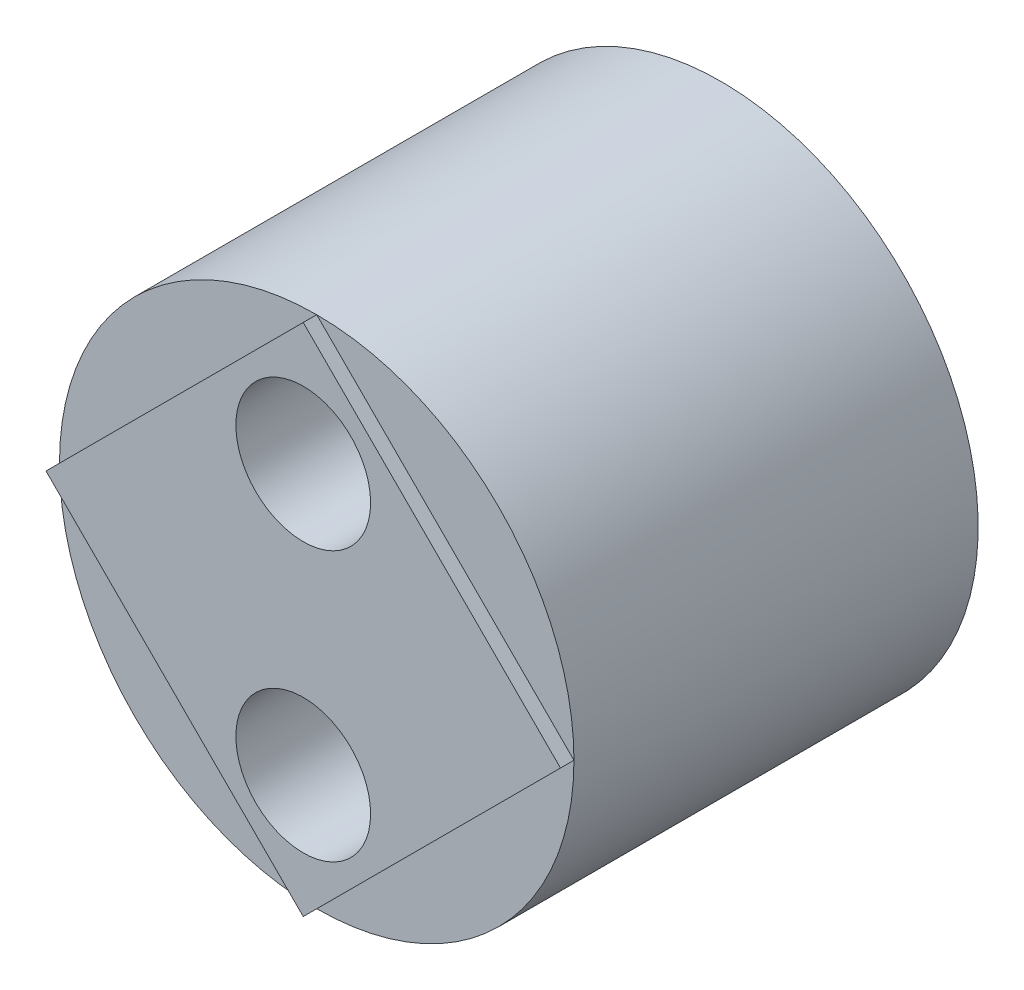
ISO-10303-21;
HEADER;
FILE_DESCRIPTION(('STEP AP214'),'2;1');
FILE_NAME('part.step','',(''),(''),'','','');
FILE_SCHEMA(('AUTOMOTIVE_DESIGN { 1 0 10303 214 1 1 1 1 }'));
ENDSEC;
DATA;
#1=APPLICATION_CONTEXT('core data for automotive mechanical design processes');
#2=APPLICATION_PROTOCOL_DEFINITION('international standard','automotive_design',2000,#1);
#3=PRODUCT_CONTEXT('',#1,'mechanical');
#4=PRODUCT('Part','Part','',(#3));
#5=PRODUCT_RELATED_PRODUCT_CATEGORY('part','',(#4));
#6=PRODUCT_DEFINITION_FORMATION('','',#4);
#7=PRODUCT_DEFINITION_CONTEXT('part definition',#1,'design');
#8=PRODUCT_DEFINITION('design','',#6,#7);
#9=PRODUCT_DEFINITION_SHAPE('','',#8);
#10=(LENGTH_UNIT() NAMED_UNIT(*) SI_UNIT(.MILLI.,.METRE.));
#11=(NAMED_UNIT(*) PLANE_ANGLE_UNIT() SI_UNIT($,.RADIAN.));
#12=(NAMED_UNIT(*) SI_UNIT($,.STERADIAN.) SOLID_ANGLE_UNIT());
#13=UNCERTAINTY_MEASURE_WITH_UNIT(LENGTH_MEASURE(1.E-05),#10,'distance_accuracy_value','');
#14=(GEOMETRIC_REPRESENTATION_CONTEXT(3) GLOBAL_UNCERTAINTY_ASSIGNED_CONTEXT((#13)) GLOBAL_UNIT_ASSIGNED_CONTEXT((#10,
#11,#12)) REPRESENTATION_CONTEXT('',''));
#15=CARTESIAN_POINT('',(0.,0.,0.));
#16=DIRECTION('',(0.,0.,1.));
#17=DIRECTION('',(1.,0.,0.));
#18=AXIS2_PLACEMENT_3D('',#15,#16,#17);
#19=CARTESIAN_POINT('',(0.,0.,-66.));
#20=DIRECTION('',(0.,0.,1.));
#21=DIRECTION('',(1.,0.,0.));
#22=AXIS2_PLACEMENT_3D('',#19,#20,#21);
#23=CYLINDRICAL_SURFACE('',#22,19.0918830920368);
#24=CARTESIAN_POINT('',(0.,0.,30.));
#25=DIRECTION('',(0.,0.,1.));
#26=DIRECTION('',(1.,0.,0.));
#27=AXIS2_PLACEMENT_3D('',#24,#25,#26);
#28=CIRCLE('',#27,19.0918830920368);
#29=CARTESIAN_POINT('',(0.,-19.0918830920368,30.));
#30=VERTEX_POINT('',#29);
#31=CARTESIAN_POINT('',(19.0918830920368,0.,30.));
#32=VERTEX_POINT('',#31);
#33=EDGE_CURVE('E67',#30,#32,#28,.T.);
#34=ORIENTED_EDGE('',*,*,#33,.F.);
#35=CARTESIAN_POINT('',(-19.0918830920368,0.,30.));
#36=VERTEX_POINT('',#35);
#37=EDGE_CURVE('E57',#36,#30,#28,.T.);
#38=ORIENTED_EDGE('',*,*,#37,.F.);
#39=CARTESIAN_POINT('',(0.,19.0918830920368,30.));
#40=VERTEX_POINT('',#39);
#41=EDGE_CURVE('E54',#40,#36,#28,.T.);
#42=ORIENTED_EDGE('',*,*,#41,.F.);
#43=EDGE_CURVE('E29',#32,#40,#28,.T.);
#44=ORIENTED_EDGE('',*,*,#43,.F.);
#45=EDGE_LOOP('',(#34,#38,#42,#44));
#46=FACE_BOUND('',#45,.T.);
#47=CARTESIAN_POINT('',(0.,0.,0.));
#48=DIRECTION('',(0.,0.,-1.));
#49=DIRECTION('',(-1.,0.,0.));
#50=AXIS2_PLACEMENT_3D('',#47,#48,#49);
#51=CIRCLE('',#50,19.0918830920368);
#52=CARTESIAN_POINT('',(-19.0918830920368,0.,0.));
#53=VERTEX_POINT('',#52);
#54=EDGE_CURVE('E60',#53,#53,#51,.T.);
#55=ORIENTED_EDGE('',*,*,#54,.F.);
#56=EDGE_LOOP('',(#55));
#57=FACE_BOUND('',#56,.T.);
#58=ADVANCED_FACE('F14',(#46,#57),#23,.T.);
#59=CARTESIAN_POINT('',(-25.,-25.,30.));
#60=DIRECTION('',(0.,0.,1.));
#61=DIRECTION('',(1.,0.,0.));
#62=AXIS2_PLACEMENT_3D('',#59,#60,#61);
#63=PLANE('',#62);
#64=DIRECTION('',(-0.707106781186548,0.707106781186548,0.));
#65=VECTOR('',#64,1.);
#66=CARTESIAN_POINT('',(0.,19.0918830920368,30.));
#67=LINE('',#66,#65);
#68=EDGE_CURVE('E65',#32,#40,#67,.T.);
#69=ORIENTED_EDGE('',*,*,#68,.F.);
#70=ORIENTED_EDGE('',*,*,#43,.T.);
#71=EDGE_LOOP('',(#69,#70));
#72=FACE_BOUND('',#71,.T.);
#73=ADVANCED_FACE('F16',(#72),#63,.T.);
#74=DIRECTION('',(-0.707106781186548,-0.707106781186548,0.));
#75=VECTOR('',#74,1.);
#76=CARTESIAN_POINT('',(-19.0918830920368,0.,30.));
#77=LINE('',#76,#75);
#78=EDGE_CURVE('E84',#40,#36,#77,.T.);
#79=ORIENTED_EDGE('',*,*,#78,.F.);
#80=ORIENTED_EDGE('',*,*,#41,.T.);
#81=EDGE_LOOP('',(#79,#80));
#82=FACE_BOUND('',#81,.T.);
#83=ADVANCED_FACE('F87',(#82),#63,.T.);
#84=DIRECTION('',(0.707106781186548,-0.707106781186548,0.));
#85=VECTOR('',#84,1.);
#86=CARTESIAN_POINT('',(-19.0918830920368,0.,30.));
#87=LINE('',#86,#85);
#88=EDGE_CURVE('E88',#36,#30,#87,.T.);
#89=ORIENTED_EDGE('',*,*,#88,.F.);
#90=ORIENTED_EDGE('',*,*,#37,.T.);
#91=EDGE_LOOP('',(#89,#90));
#92=FACE_BOUND('',#91,.T.);
#93=ADVANCED_FACE('F124',(#92),#63,.T.);
#94=DIRECTION('',(0.707106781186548,0.707106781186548,0.));
#95=VECTOR('',#94,1.);
#96=CARTESIAN_POINT('',(0.,-19.0918830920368,30.));
#97=LINE('',#96,#95);
#98=EDGE_CURVE('E78',#30,#32,#97,.T.);
#99=ORIENTED_EDGE('',*,*,#98,.F.);
#100=ORIENTED_EDGE('',*,*,#33,.T.);
#101=EDGE_LOOP('',(#99,#100));
#102=FACE_BOUND('',#101,.T.);
#103=ADVANCED_FACE('F109',(#102),#63,.T.);
#104=CARTESIAN_POINT('',(-19.0918830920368,0.,31.));
#105=DIRECTION('',(0.707106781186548,-0.707106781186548,0.));
#106=DIRECTION('',(0.707106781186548,0.707106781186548,0.));
#107=AXIS2_PLACEMENT_3D('',#104,#105,#106);
#108=PLANE('',#107);
#109=ORIENTED_EDGE('',*,*,#78,.T.);
#110=DIRECTION('',(0.,0.,-1.));
#111=VECTOR('',#110,1.);
#112=CARTESIAN_POINT('',(-19.0918830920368,0.,31.));
#113=LINE('',#112,#111);
#114=CARTESIAN_POINT('',(-19.0918830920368,0.,31.));
#115=VERTEX_POINT('',#114);
#116=EDGE_CURVE('E9',#115,#36,#113,.T.);
#117=ORIENTED_EDGE('',*,*,#116,.F.);
#118=DIRECTION('',(-0.707106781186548,-0.707106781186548,0.));
#119=VECTOR('',#118,1.);
#120=CARTESIAN_POINT('',(-19.0918830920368,0.,31.));
#121=LINE('',#120,#119);
#122=CARTESIAN_POINT('',(0.,19.0918830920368,31.));
#123=VERTEX_POINT('',#122);
#124=EDGE_CURVE('E77',#123,#115,#121,.T.);
#125=ORIENTED_EDGE('',*,*,#124,.F.);
#126=DIRECTION('',(0.,0.,-1.));
#127=VECTOR('',#126,1.);
#128=CARTESIAN_POINT('',(0.,19.0918830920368,31.));
#129=LINE('',#128,#127);
#130=EDGE_CURVE('E72',#123,#40,#129,.T.);
#131=ORIENTED_EDGE('',*,*,#130,.T.);
#132=EDGE_LOOP('',(#109,#117,#125,#131));
#133=FACE_BOUND('',#132,.T.);
#134=ADVANCED_FACE('F82',(#133),#108,.F.);
#135=CARTESIAN_POINT('',(-19.0918830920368,0.,31.));
#136=DIRECTION('',(0.707106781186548,0.707106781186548,0.));
#137=DIRECTION('',(-0.707106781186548,0.707106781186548,0.));
#138=AXIS2_PLACEMENT_3D('',#135,#136,#137);
#139=PLANE('',#138);
#140=ORIENTED_EDGE('',*,*,#88,.T.);
#141=DIRECTION('',(0.,0.,-1.));
#142=VECTOR('',#141,1.);
#143=CARTESIAN_POINT('',(0.,-19.0918830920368,31.));
#144=LINE('',#143,#142);
#145=CARTESIAN_POINT('',(0.,-19.0918830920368,31.));
#146=VERTEX_POINT('',#145);
#147=EDGE_CURVE('E22',#146,#30,#144,.T.);
#148=ORIENTED_EDGE('',*,*,#147,.F.);
#149=DIRECTION('',(0.707106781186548,-0.707106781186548,0.));
#150=VECTOR('',#149,1.);
#151=CARTESIAN_POINT('',(-19.0918830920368,0.,31.));
#152=LINE('',#151,#150);
#153=EDGE_CURVE('E120',#115,#146,#152,.T.);
#154=ORIENTED_EDGE('',*,*,#153,.F.);
#155=ORIENTED_EDGE('',*,*,#116,.T.);
#156=EDGE_LOOP('',(#140,#148,#154,#155));
#157=FACE_BOUND('',#156,.T.);
#158=ADVANCED_FACE('F122',(#157),#139,.F.);
#159=CARTESIAN_POINT('',(0.,-19.0918830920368,31.));
#160=DIRECTION('',(-0.707106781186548,0.707106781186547,0.));
#161=DIRECTION('',(-0.707106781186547,-0.707106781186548,0.));
#162=AXIS2_PLACEMENT_3D('',#159,#160,#161);
#163=PLANE('',#162);
#164=ORIENTED_EDGE('',*,*,#98,.T.);
#165=DIRECTION('',(0.,0.,-1.));
#166=VECTOR('',#165,1.);
#167=CARTESIAN_POINT('',(19.0918830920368,0.,31.));
#168=LINE('',#167,#166);
#169=CARTESIAN_POINT('',(19.0918830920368,0.,31.));
#170=VERTEX_POINT('',#169);
#171=EDGE_CURVE('E75',#170,#32,#168,.T.);
#172=ORIENTED_EDGE('',*,*,#171,.F.);
#173=DIRECTION('',(0.707106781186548,0.707106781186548,0.));
#174=VECTOR('',#173,1.);
#175=CARTESIAN_POINT('',(0.,-19.0918830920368,31.));
#176=LINE('',#175,#174);
#177=EDGE_CURVE('E106',#146,#170,#176,.T.);
#178=ORIENTED_EDGE('',*,*,#177,.F.);
#179=ORIENTED_EDGE('',*,*,#147,.T.);
#180=EDGE_LOOP('',(#164,#172,#178,#179));
#181=FACE_BOUND('',#180,.T.);
#182=ADVANCED_FACE('F105',(#181),#163,.F.);
#183=CARTESIAN_POINT('',(0.,19.0918830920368,31.));
#184=DIRECTION('',(-0.707106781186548,-0.707106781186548,0.));
#185=DIRECTION('',(0.707106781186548,-0.707106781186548,0.));
#186=AXIS2_PLACEMENT_3D('',#183,#184,#185);
#187=PLANE('',#186);
#188=ORIENTED_EDGE('',*,*,#68,.T.);
#189=ORIENTED_EDGE('',*,*,#130,.F.);
#190=DIRECTION('',(-0.707106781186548,0.707106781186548,0.));
#191=VECTOR('',#190,1.);
#192=CARTESIAN_POINT('',(0.,19.0918830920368,31.));
#193=LINE('',#192,#191);
#194=EDGE_CURVE('E37',#170,#123,#193,.T.);
#195=ORIENTED_EDGE('',*,*,#194,.F.);
#196=ORIENTED_EDGE('',*,*,#171,.T.);
#197=EDGE_LOOP('',(#188,#189,#195,#196));
#198=FACE_BOUND('',#197,.T.);
#199=ADVANCED_FACE('F71',(#198),#187,.F.);
#200=CARTESIAN_POINT('',(0.,19.0918830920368,31.));
#201=DIRECTION('',(0.,0.,-1.));
#202=DIRECTION('',(-1.,0.,0.));
#203=AXIS2_PLACEMENT_3D('',#200,#201,#202);
#204=PLANE('',#203);
#205=CARTESIAN_POINT('',(0.,-10.,31.));
#206=DIRECTION('',(0.,0.,1.));
#207=DIRECTION('',(1.,0.,0.));
#208=AXIS2_PLACEMENT_3D('',#205,#206,#207);
#209=CIRCLE('',#208,5.);
#210=CARTESIAN_POINT('',(5.,-10.,31.));
#211=VERTEX_POINT('',#210);
#212=EDGE_CURVE('E66',#211,#211,#209,.T.);
#213=ORIENTED_EDGE('',*,*,#212,.F.);
#214=EDGE_LOOP('',(#213));
#215=FACE_BOUND('',#214,.T.);
#216=CARTESIAN_POINT('',(0.,10.,31.));
#217=DIRECTION('',(0.,0.,1.));
#218=DIRECTION('',(1.,0.,0.));
#219=AXIS2_PLACEMENT_3D('',#216,#217,#218);
#220=CIRCLE('',#219,5.);
#221=CARTESIAN_POINT('',(5.,10.,31.));
#222=VERTEX_POINT('',#221);
#223=EDGE_CURVE('E94',#222,#222,#220,.T.);
#224=ORIENTED_EDGE('',*,*,#223,.F.);
#225=EDGE_LOOP('',(#224));
#226=FACE_BOUND('',#225,.T.);
#227=ORIENTED_EDGE('',*,*,#124,.T.);
#228=ORIENTED_EDGE('',*,*,#153,.T.);
#229=ORIENTED_EDGE('',*,*,#177,.T.);
#230=ORIENTED_EDGE('',*,*,#194,.T.);
#231=EDGE_LOOP('',(#227,#228,#229,#230));
#232=FACE_BOUND('',#231,.T.);
#233=ADVANCED_FACE('F121',(#215,#226,#232),#204,.F.);
#234=CARTESIAN_POINT('',(0.,10.,6.));
#235=DIRECTION('',(0.,0.,1.));
#236=DIRECTION('',(1.,0.,0.));
#237=AXIS2_PLACEMENT_3D('',#234,#235,#236);
#238=CYLINDRICAL_SURFACE('',#237,5.);
#239=CARTESIAN_POINT('',(0.,10.,6.));
#240=DIRECTION('',(0.,0.,1.));
#241=DIRECTION('',(1.,0.,0.));
#242=AXIS2_PLACEMENT_3D('',#239,#240,#241);
#243=CIRCLE('',#242,5.);
#244=CARTESIAN_POINT('',(5.,10.,6.));
#245=VERTEX_POINT('',#244);
#246=EDGE_CURVE('E89',#245,#245,#243,.T.);
#247=ORIENTED_EDGE('',*,*,#246,.F.);
#248=EDGE_LOOP('',(#247));
#249=FACE_BOUND('',#248,.T.);
#250=ORIENTED_EDGE('',*,*,#223,.T.);
#251=EDGE_LOOP('',(#250));
#252=FACE_BOUND('',#251,.T.);
#253=ADVANCED_FACE('F152',(#249,#252),#238,.F.);
#254=CARTESIAN_POINT('',(0.,10.,6.));
#255=DIRECTION('',(0.,0.,1.));
#256=DIRECTION('',(1.,0.,0.));
#257=AXIS2_PLACEMENT_3D('',#254,#255,#256);
#258=PLANE('',#257);
#259=ORIENTED_EDGE('',*,*,#246,.T.);
#260=EDGE_LOOP('',(#259));
#261=FACE_BOUND('',#260,.T.);
#262=ADVANCED_FACE('F148',(#261),#258,.T.);
#263=CARTESIAN_POINT('',(0.,-10.,6.));
#264=DIRECTION('',(0.,0.,1.));
#265=DIRECTION('',(1.,0.,0.));
#266=AXIS2_PLACEMENT_3D('',#263,#264,#265);
#267=CYLINDRICAL_SURFACE('',#266,5.);
#268=CARTESIAN_POINT('',(0.,-10.,6.));
#269=DIRECTION('',(0.,0.,1.));
#270=DIRECTION('',(1.,0.,0.));
#271=AXIS2_PLACEMENT_3D('',#268,#269,#270);
#272=CIRCLE('',#271,5.);
#273=CARTESIAN_POINT('',(5.,-10.,6.));
#274=VERTEX_POINT('',#273);
#275=EDGE_CURVE('E112',#274,#274,#272,.T.);
#276=ORIENTED_EDGE('',*,*,#275,.F.);
#277=EDGE_LOOP('',(#276));
#278=FACE_BOUND('',#277,.T.);
#279=ORIENTED_EDGE('',*,*,#212,.T.);
#280=EDGE_LOOP('',(#279));
#281=FACE_BOUND('',#280,.T.);
#282=ADVANCED_FACE('F144',(#278,#281),#267,.F.);
#283=CARTESIAN_POINT('',(0.,-10.,6.));
#284=DIRECTION('',(0.,0.,1.));
#285=DIRECTION('',(1.,0.,0.));
#286=AXIS2_PLACEMENT_3D('',#283,#284,#285);
#287=PLANE('',#286);
#288=ORIENTED_EDGE('',*,*,#275,.T.);
#289=EDGE_LOOP('',(#288));
#290=FACE_BOUND('',#289,.T.);
#291=ADVANCED_FACE('F141',(#290),#287,.T.);
#292=CARTESIAN_POINT('',(0.,0.,0.));
#293=DIRECTION('',(0.,0.,-1.));
#294=DIRECTION('',(-1.,0.,0.));
#295=AXIS2_PLACEMENT_3D('',#292,#293,#294);
#296=PLANE('',#295);
#297=ORIENTED_EDGE('',*,*,#54,.T.);
#298=EDGE_LOOP('',(#297));
#299=FACE_BOUND('',#298,.T.);
#300=ADVANCED_FACE('F140',(#299),#296,.T.);
#301=CLOSED_SHELL('',(#58,#73,#83,#93,#103,#134,#158,#182,#199,#233,#253,#262,#282,#291,#300));
#302=MANIFOLD_SOLID_BREP('B1',#301);
#303=ADVANCED_BREP_SHAPE_REPRESENTATION('',(#18,#302),#14);
#304=SHAPE_DEFINITION_REPRESENTATION(#9,#303);
ENDSEC;
END-ISO-10303-21;
